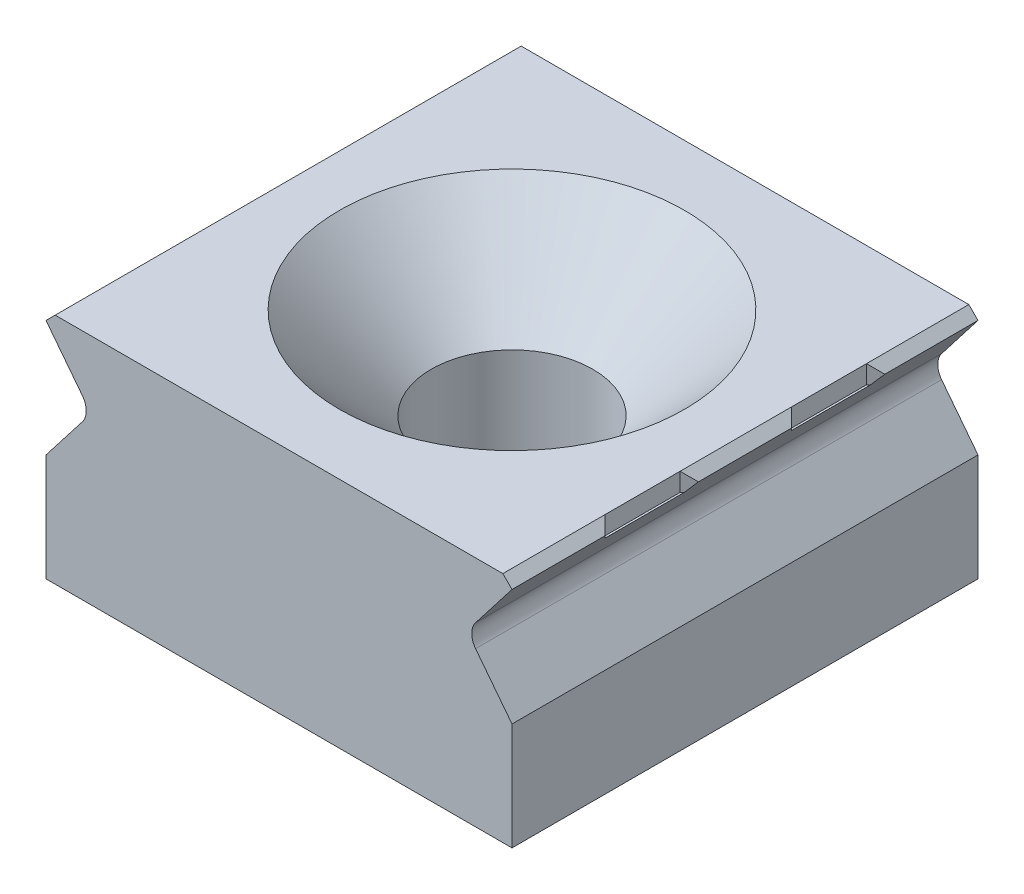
from build123d import *

# Parameters (mm, degrees)
SKETCH1_W           = 25.4
SKETCH1_H           = 25.4
BOSS_EXTRUDE1_DEPTH = 6.35
CHAMFER1_SIZE       = 0.5
CUT_EXTRUDE1_DEPTH  = 25.4
CUT_EXTRUDE2_DEPTH  = 1
LPATTERN1_COUNT     = 2
LPATTERN1_PITCH     = 10.16
SKETCH4_R           = 4.4
CUT_EXTRUDE3_DEPTH  = 12.7
CHAMFER2_SIZE       = 5


with BuildPart() as part:
    # Sketch1 → Boss-Extrude1 (new, symmetric)
    with BuildSketch(Plane(origin=(0, 0, 0), x_dir=(1, 0, 0), z_dir=(0, 1, 0))):
        Rectangle(SKETCH1_W, SKETCH1_H)
    extrude(amount=BOSS_EXTRUDE1_DEPTH, both=True)

    # Chamfer1
    chamfer1_edges = [part.edges().sort_by_distance(p)[0] for p in [
        (12.7, 6.35, 0),
        (-12.7, 6.35, 0),
    ]]
    chamfer(chamfer1_edges, length=CHAMFER1_SIZE)

    # Sketch2 → Cut-Extrude1 (cut)
    with BuildSketch(Plane.XY.offset(12.7)):
        with BuildLine():
            Line((-12.7, 5.85), (-12.7, -0.5))
            Line((-12.7, -0.5), (-10.714547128, 2.062525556))
            ThreePointArc((-10.714547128, 2.062525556), (-10.505037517, 2.675), (-10.714547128, 3.287474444))
            Line((-10.714547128, 3.287474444), (-12.7, 5.85))
        make_face()
    cut_extrude1 = extrude(amount=-CUT_EXTRUDE1_DEPTH, mode=Mode.SUBTRACT)

    # Mirror1: Cut-Extrude1 across plane
    add(cut_extrude1.mirror(Plane(origin=(0, 0, 0), x_dir=(0, 0, 1), z_dir=(1, 0, 0))), mode=Mode.SUBTRACT)

    # Sketch3 → Cut-Extrude2 (cut)
    with BuildSketch(Plane(origin=(0, 6.35, 0), x_dir=(1, 0, 0), z_dir=(0, 1, 0))):
        Polygon((-12.7, -7.62), (-12.7, -2.54), (-12.2, -3.04), (-12.2, -7.12), align=None)
        Polygon((12.7, -7.62), (12.2, -7.119999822), (12.2, -3.039999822), (12.7, -2.54), align=None)
    cut_extrude2 = extrude(amount=-CUT_EXTRUDE2_DEPTH, mode=Mode.SUBTRACT)

    # LPattern1: Cut-Extrude2 ×2
    with Locations(*[(0, 0, -i * LPATTERN1_PITCH) for i in range(1, LPATTERN1_COUNT)]):
        add(cut_extrude2, mode=Mode.SUBTRACT)

    # Sketch4 → Cut-Extrude3 (cut)
    with BuildSketch(Plane(origin=(0, 6.35, 0), x_dir=(1, 0, 0), z_dir=(0, 1, 0))):
        with Locations(Location((0, 0, 0), (0, 0, 270))):
            Circle(SKETCH4_R)
    extrude(amount=-CUT_EXTRUDE3_DEPTH, mode=Mode.SUBTRACT)

    # Chamfer2
    chamfer2_edges = [part.edges().sort_by_distance(p)[0] for p in [
        (0, 6.35, -4.4),
    ]]
    chamfer(chamfer2_edges, length=CHAMFER2_SIZE)


solid = part.part
